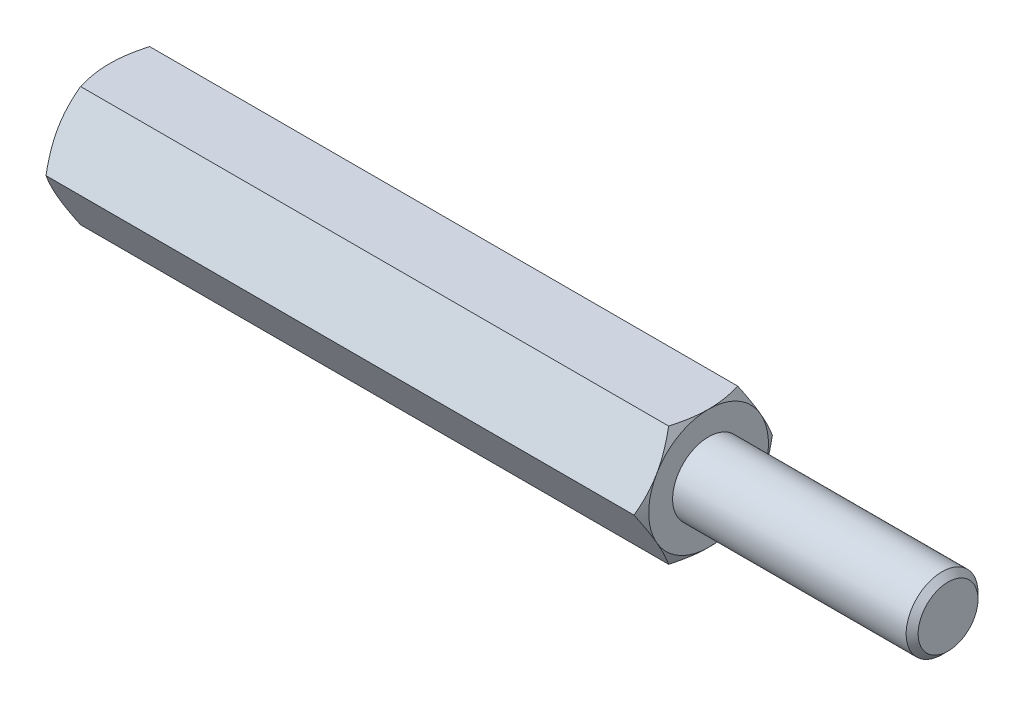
ISO-10303-21;
HEADER;
FILE_DESCRIPTION(('STEP AP214'),'2;1');
FILE_NAME('part.step','',(''),(''),'','','');
FILE_SCHEMA(('AUTOMOTIVE_DESIGN { 1 0 10303 214 1 1 1 1 }'));
ENDSEC;
DATA;
#1=APPLICATION_CONTEXT('core data for automotive mechanical design processes');
#2=APPLICATION_PROTOCOL_DEFINITION('international standard','automotive_design',2000,#1);
#3=PRODUCT_CONTEXT('',#1,'mechanical');
#4=PRODUCT('Part','Part','',(#3));
#5=PRODUCT_RELATED_PRODUCT_CATEGORY('part','',(#4));
#6=PRODUCT_DEFINITION_FORMATION('','',#4);
#7=PRODUCT_DEFINITION_CONTEXT('part definition',#1,'design');
#8=PRODUCT_DEFINITION('design','',#6,#7);
#9=PRODUCT_DEFINITION_SHAPE('','',#8);
#10=(LENGTH_UNIT() NAMED_UNIT(*) SI_UNIT(.MILLI.,.METRE.));
#11=(NAMED_UNIT(*) PLANE_ANGLE_UNIT() SI_UNIT($,.RADIAN.));
#12=(NAMED_UNIT(*) SI_UNIT($,.STERADIAN.) SOLID_ANGLE_UNIT());
#13=UNCERTAINTY_MEASURE_WITH_UNIT(LENGTH_MEASURE(1.E-05),#10,'distance_accuracy_value','');
#14=(GEOMETRIC_REPRESENTATION_CONTEXT(3) GLOBAL_UNCERTAINTY_ASSIGNED_CONTEXT((#13)) GLOBAL_UNIT_ASSIGNED_CONTEXT((#10,
#11,#12)) REPRESENTATION_CONTEXT('',''));
#15=CARTESIAN_POINT('',(0.,0.,0.));
#16=DIRECTION('',(0.,0.,1.));
#17=DIRECTION('',(1.,0.,0.));
#18=AXIS2_PLACEMENT_3D('',#15,#16,#17);
#19=CARTESIAN_POINT('',(12.5,2.5,-1.44337567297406));
#20=DIRECTION('',(1.,0.,0.));
#21=DIRECTION('',(0.,0.,-1.));
#22=AXIS2_PLACEMENT_3D('',#19,#20,#21);
#23=PLANE('',#22);
#24=CARTESIAN_POINT('',(12.5,0.,0.));
#25=DIRECTION('',(1.,0.,0.));
#26=DIRECTION('',(0.,0.,-1.));
#27=AXIS2_PLACEMENT_3D('',#24,#25,#26);
#28=CIRCLE('',#27,2.5);
#29=CARTESIAN_POINT('',(12.5,-1.25,-2.1650635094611));
#30=VERTEX_POINT('',#29);
#31=CARTESIAN_POINT('',(12.5,1.25,-2.1650635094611));
#32=VERTEX_POINT('',#31);
#33=EDGE_CURVE('E288',#30,#32,#28,.T.);
#34=ORIENTED_EDGE('',*,*,#33,.T.);
#35=CARTESIAN_POINT('',(12.5,2.5,0.));
#36=VERTEX_POINT('',#35);
#37=EDGE_CURVE('E53',#32,#36,#28,.T.);
#38=ORIENTED_EDGE('',*,*,#37,.T.);
#39=CARTESIAN_POINT('',(12.5,1.25,2.1650635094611));
#40=VERTEX_POINT('',#39);
#41=EDGE_CURVE('E297',#36,#40,#28,.T.);
#42=ORIENTED_EDGE('',*,*,#41,.T.);
#43=CARTESIAN_POINT('',(12.5,-1.25,2.1650635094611));
#44=VERTEX_POINT('',#43);
#45=EDGE_CURVE('E303',#40,#44,#28,.T.);
#46=ORIENTED_EDGE('',*,*,#45,.T.);
#47=CARTESIAN_POINT('',(12.5,0.,0.));
#48=DIRECTION('',(-1.,0.,0.));
#49=DIRECTION('',(0.,-1.,0.));
#50=AXIS2_PLACEMENT_3D('',#47,#48,#49);
#51=CIRCLE('',#50,2.5);
#52=CARTESIAN_POINT('',(12.5,-2.50000000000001,0.));
#53=VERTEX_POINT('',#52);
#54=EDGE_CURVE('E193',#53,#44,#51,.T.);
#55=ORIENTED_EDGE('',*,*,#54,.F.);
#56=EDGE_CURVE('E61',#53,#30,#28,.T.);
#57=ORIENTED_EDGE('',*,*,#56,.T.);
#58=EDGE_LOOP('',(#34,#38,#42,#46,#55,#57));
#59=FACE_BOUND('',#58,.T.);
#60=CARTESIAN_POINT('',(12.5,0.,0.));
#61=DIRECTION('',(1.,0.,0.));
#62=DIRECTION('',(0.,0.,-1.));
#63=AXIS2_PLACEMENT_3D('',#60,#61,#62);
#64=CIRCLE('',#63,1.5);
#65=CARTESIAN_POINT('',(12.5,0.,-1.5));
#66=VERTEX_POINT('',#65);
#67=EDGE_CURVE('E468',#66,#66,#64,.T.);
#68=ORIENTED_EDGE('',*,*,#67,.F.);
#69=EDGE_LOOP('',(#68));
#70=FACE_BOUND('',#69,.T.);
#71=ADVANCED_FACE('F37',(#59,#70),#23,.T.);
#72=CARTESIAN_POINT('',(12.5,0.,-2.88675134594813));
#73=DIRECTION('',(0.,-0.5,0.866025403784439));
#74=DIRECTION('',(0.,-0.866025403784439,-0.5));
#75=AXIS2_PLACEMENT_3D('',#72,#73,#74);
#76=PLANE('',#75);
#77=CARTESIAN_POINT('',(12.2766423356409,-0.000199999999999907,-2.88686681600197));
#78=CARTESIAN_POINT('',(12.3132783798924,0.109663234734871,-2.82343724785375));
#79=CARTESIAN_POINT('',(12.3465977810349,0.220474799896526,-2.75946016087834));
#80=CARTESIAN_POINT('',(12.4047577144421,0.444016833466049,-2.63039810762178));
#81=CARTESIAN_POINT('',(12.4295776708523,0.556751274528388,-2.5653108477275));
#82=CARTESIAN_POINT('',(12.468214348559,0.780822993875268,-2.43594298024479));
#83=CARTESIAN_POINT('',(12.4822882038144,0.892125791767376,-2.37168227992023));
#84=CARTESIAN_POINT('',(12.4990908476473,1.11525522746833,-2.24285844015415));
#85=CARTESIAN_POINT('',(12.5018335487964,1.22708105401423,-2.17829576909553));
#86=CARTESIAN_POINT('',(12.4961342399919,1.43604197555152,-2.05765212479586));
#87=CARTESIAN_POINT('',(12.4890916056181,1.53320831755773,-2.0015531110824));
#88=CARTESIAN_POINT('',(12.4667685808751,1.726907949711,-1.88972057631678));
#89=CARTESIAN_POINT('',(12.4514805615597,1.82344056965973,-1.8339874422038));
#90=CARTESIAN_POINT('',(12.4132609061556,2.01753972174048,-1.7219242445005));
#91=CARTESIAN_POINT('',(12.3901672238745,2.11508168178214,-1.66560836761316));
#92=CARTESIAN_POINT('',(12.3377533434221,2.30871060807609,-1.55381665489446));
#93=CARTESIAN_POINT('',(12.3084454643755,2.40480005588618,-1.49833938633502));
#94=CARTESIAN_POINT('',(12.2766423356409,2.5002,-1.44326020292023));
#95=B_SPLINE_CURVE_WITH_KNOTS('',3,(#77,#78,#79,#80,#81,#82,#83,#84,#85,#86,#87,#88,#89,#90,#91,
#92,#93,#94),.UNSPECIFIED.,.F.,.F.,(4,2,2,2,2,2,2,2,4),(0.,0.396285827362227,0.79352433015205,
1.18093086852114,1.56786160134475,1.90479741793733,2.24204551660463,2.58677531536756,
2.93082800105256),.UNSPECIFIED.);
#96=CARTESIAN_POINT('',(12.2767090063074,0.,-2.88675134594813));
#97=VERTEX_POINT('',#96);
#98=EDGE_CURVE('E343',#97,#32,#95,.T.);
#99=ORIENTED_EDGE('',*,*,#98,.F.);
#100=DIRECTION('',(-1.,0.,0.));
#101=VECTOR('',#100,1.);
#102=CARTESIAN_POINT('',(12.5,0.,-2.88675134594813));
#103=LINE('',#102,#101);
#104=CARTESIAN_POINT('',(-12.2767090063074,0.,-2.88675134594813));
#105=VERTEX_POINT('',#104);
#106=EDGE_CURVE('E264',#97,#105,#103,.T.);
#107=ORIENTED_EDGE('',*,*,#106,.T.);
#108=CARTESIAN_POINT('',(-12.2766423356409,2.5002,-1.44326020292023));
#109=CARTESIAN_POINT('',(-12.3132783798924,2.39033676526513,-1.50668977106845));
#110=CARTESIAN_POINT('',(-12.3465977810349,2.27952520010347,-1.57066685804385));
#111=CARTESIAN_POINT('',(-12.4047577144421,2.05598316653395,-1.69972891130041));
#112=CARTESIAN_POINT('',(-12.4295776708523,1.94324872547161,-1.7648161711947));
#113=CARTESIAN_POINT('',(-12.468214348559,1.71917700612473,-1.8941840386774));
#114=CARTESIAN_POINT('',(-12.4822882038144,1.60787420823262,-1.95844473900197));
#115=CARTESIAN_POINT('',(-12.4990908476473,1.38474477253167,-2.08726857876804));
#116=CARTESIAN_POINT('',(-12.5018335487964,1.27291894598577,-2.15183124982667));
#117=CARTESIAN_POINT('',(-12.4961342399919,1.06395802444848,-2.27247489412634));
#118=CARTESIAN_POINT('',(-12.4890916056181,0.96679168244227,-2.32857390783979));
#119=CARTESIAN_POINT('',(-12.4667685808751,0.773092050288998,-2.44040644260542));
#120=CARTESIAN_POINT('',(-12.4514805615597,0.676559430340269,-2.49613957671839));
#121=CARTESIAN_POINT('',(-12.4132609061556,0.482460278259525,-2.60820277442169));
#122=CARTESIAN_POINT('',(-12.3901672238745,0.38491831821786,-2.66451865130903));
#123=CARTESIAN_POINT('',(-12.3377533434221,0.191289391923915,-2.77631036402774));
#124=CARTESIAN_POINT('',(-12.3084454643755,0.0951999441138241,-2.83178763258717));
#125=CARTESIAN_POINT('',(-12.2766423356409,-0.000199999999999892,-2.88686681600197));
#126=B_SPLINE_CURVE_WITH_KNOTS('',3,(#108,#109,#110,#111,#112,#113,#114,#115,#116,#117,#118,
#119,#120,#121,#122,#123,#124,#125),.UNSPECIFIED.,.F.,.F.,(4,2,2,2,2,2,2,2,4),(0.,
0.396285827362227,0.79352433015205,1.18093086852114,1.56786160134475,1.90479741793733,
2.24204551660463,2.58677531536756,2.93082800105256),.UNSPECIFIED.);
#127=CARTESIAN_POINT('',(-12.5,1.25,-2.1650635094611));
#128=VERTEX_POINT('',#127);
#129=EDGE_CURVE('E313',#128,#105,#126,.T.);
#130=ORIENTED_EDGE('',*,*,#129,.F.);
#131=CARTESIAN_POINT('',(-12.2767090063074,2.5,-1.44337567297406));
#132=VERTEX_POINT('',#131);
#133=EDGE_CURVE('E392',#132,#128,#126,.T.);
#134=ORIENTED_EDGE('',*,*,#133,.F.);
#135=DIRECTION('',(-1.,0.,0.));
#136=VECTOR('',#135,1.);
#137=CARTESIAN_POINT('',(12.5,2.5,-1.44337567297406));
#138=LINE('',#137,#136);
#139=CARTESIAN_POINT('',(12.2767090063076,2.5,-1.44337567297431));
#140=VERTEX_POINT('',#139);
#141=EDGE_CURVE('E279',#140,#132,#138,.T.);
#142=ORIENTED_EDGE('',*,*,#141,.F.);
#143=EDGE_CURVE('E229',#32,#140,#95,.T.);
#144=ORIENTED_EDGE('',*,*,#143,.F.);
#145=EDGE_LOOP('',(#99,#107,#130,#134,#142,#144));
#146=FACE_BOUND('',#145,.T.);
#147=ADVANCED_FACE('F148',(#146),#76,.F.);
#148=CARTESIAN_POINT('',(12.5,2.5,-1.44337567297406));
#149=DIRECTION('',(0.,-1.,0.));
#150=DIRECTION('',(0.,0.,-1.));
#151=AXIS2_PLACEMENT_3D('',#148,#149,#150);
#152=PLANE('',#151);
#153=CARTESIAN_POINT('',(11.2680338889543,2.5,-3.90158441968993));
#154=CARTESIAN_POINT('',(11.3212077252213,2.5,-3.79217004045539));
#155=CARTESIAN_POINT('',(11.3738786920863,2.5,-3.68250707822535));
#156=CARTESIAN_POINT('',(11.4779324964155,2.5,-3.46255185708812));
#157=CARTESIAN_POINT('',(11.5293151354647,2.5,-3.35225950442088));
#158=CARTESIAN_POINT('',(11.6307630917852,2.5,-3.13035696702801));
#159=CARTESIAN_POINT('',(11.6808199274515,2.5,-3.0187428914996));
#160=CARTESIAN_POINT('',(11.7789171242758,2.5,-2.79463535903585));
#161=CARTESIAN_POINT('',(11.8269575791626,2.5,-2.68214194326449));
#162=CARTESIAN_POINT('',(11.9220184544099,2.5,-2.45240385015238));
#163=CARTESIAN_POINT('',(11.9689543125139,2.5,-2.33512399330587));
#164=CARTESIAN_POINT('',(12.0593326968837,2.5,-2.09920133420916));
#165=CARTESIAN_POINT('',(12.1027748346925,2.5,-1.98055838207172));
#166=CARTESIAN_POINT('',(12.1850435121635,2.5,-1.74193489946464));
#167=CARTESIAN_POINT('',(12.2238791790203,2.5,-1.6219575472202));
#168=CARTESIAN_POINT('',(12.2957050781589,2.5,-1.38028205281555));
#169=CARTESIAN_POINT('',(12.3286971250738,2.5,-1.25858445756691));
#170=CARTESIAN_POINT('',(12.3870959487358,2.5,-1.01406369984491));
#171=CARTESIAN_POINT('',(12.4125437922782,2.5,-0.89125052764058));
#172=CARTESIAN_POINT('',(12.4544275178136,2.5,-0.64407172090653));
#173=CARTESIAN_POINT('',(12.4708643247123,2.5,-0.519706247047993));
#174=CARTESIAN_POINT('',(12.4932006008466,2.5,-0.271679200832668));
#175=CARTESIAN_POINT('',(12.4992375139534,2.5,-0.148030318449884));
#176=CARTESIAN_POINT('',(12.5006256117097,2.5,0.0993395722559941));
#177=CARTESIAN_POINT('',(12.4959765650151,2.5,0.223060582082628));
#178=CARTESIAN_POINT('',(12.4794044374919,2.5,0.432351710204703));
#179=CARTESIAN_POINT('',(12.4701066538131,2.5,0.518143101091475));
#180=CARTESIAN_POINT('',(12.4469384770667,2.5,0.689112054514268));
#181=CARTESIAN_POINT('',(12.4330674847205,2.5,0.774289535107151));
#182=CARTESIAN_POINT('',(12.3853202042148,2.5,1.02876599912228));
#183=CARTESIAN_POINT('',(12.3453176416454,2.5,1.19691958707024));
#184=CARTESIAN_POINT('',(12.2522656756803,2.5,1.53362893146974));
#185=CARTESIAN_POINT('',(12.1989362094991,2.5,1.70210423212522));
#186=CARTESIAN_POINT('',(12.1123716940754,2.5,1.95247339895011));
#187=CARTESIAN_POINT('',(12.0824247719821,2.5,2.03553184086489));
#188=CARTESIAN_POINT('',(12.0206840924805,2.5,2.20095860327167));
#189=CARTESIAN_POINT('',(11.9888903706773,2.5,2.2833269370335));
#190=CARTESIAN_POINT('',(11.904014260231,2.5,2.49723312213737));
#191=CARTESIAN_POINT('',(11.8497173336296,2.5,2.6282879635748));
#192=CARTESIAN_POINT('',(11.7381273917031,2.5,2.88912034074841));
#193=CARTESIAN_POINT('',(11.6808341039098,2.5,3.01889775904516));
#194=CARTESIAN_POINT('',(11.5639348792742,2.5,3.27745045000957));
#195=CARTESIAN_POINT('',(11.504328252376,2.5,3.40622540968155));
#196=CARTESIAN_POINT('',(11.3833234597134,2.5,3.66293235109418));
#197=CARTESIAN_POINT('',(11.321925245,2.5,3.79086430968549));
#198=CARTESIAN_POINT('',(11.1354580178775,2.5,4.17399495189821));
#199=CARTESIAN_POINT('',(11.0082824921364,2.5,4.42816724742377));
#200=CARTESIAN_POINT('',(10.7503455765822,2.5,4.93461464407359));
#201=CARTESIAN_POINT('',(10.6195848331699,2.5,5.18689007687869));
#202=CARTESIAN_POINT('',(10.3687100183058,2.5,5.66512451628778));
#203=CARTESIAN_POINT('',(10.2488298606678,2.5,5.89120644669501));
#204=CARTESIAN_POINT('',(10.0075902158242,2.5,6.34259369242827));
#205=CARTESIAN_POINT('',(9.88623065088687,2.5,6.56789896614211));
#206=CARTESIAN_POINT('',(9.64278038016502,2.5,7.01722044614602));
#207=CARTESIAN_POINT('',(9.52069305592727,2.5,7.24123848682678));
#208=CARTESIAN_POINT('',(9.27566624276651,2.5,7.68878772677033));
#209=CARTESIAN_POINT('',(9.15272681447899,2.5,7.9123189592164));
#210=CARTESIAN_POINT('',(9.02947566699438,2.5,8.13567697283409));
#211=B_SPLINE_CURVE_WITH_KNOTS('',3,(#153,#154,#155,#156,#157,#158,#159,#160,#161,#162,#163,
#164,#165,#166,#167,#168,#169,#170,#171,#172,#173,#174,#175,#176,#177,#178,#179,#180,#181,#182,
#183,#184,#185,#186,#187,#188,#189,#190,#191,#192,#193,#194,#195,#196,#197,#198,#199,#200,#201,
#202,#203,#204,#205,#206,#207,#208,#209,#210),.UNSPECIFIED.,.F.,.F.,(4,2,2,2,2,2,2,2,2,2,2,2,2,
2,2,2,2,2,2,2,2,2,2,2,2,2,2,2,4),(0.,0.364957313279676,0.729970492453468,1.09692930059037,
1.46387103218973,1.84279746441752,2.22176597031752,2.59997058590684,2.97805755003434,
3.35404692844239,3.72999770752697,4.10094071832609,4.47189175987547,4.73064905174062,
4.98944026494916,5.5072907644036,6.03710483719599,6.30196454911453,6.56681915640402,
6.99233818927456,7.41789598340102,7.84358170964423,8.26927907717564,9.12186602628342,
9.9743002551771,10.7419897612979,11.5097197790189,12.2750964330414,13.0404191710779),.UNSPECIFIED.);
#212=EDGE_CURVE('E227',#140,#36,#211,.T.);
#213=ORIENTED_EDGE('',*,*,#212,.F.);
#214=ORIENTED_EDGE('',*,*,#141,.T.);
#215=CARTESIAN_POINT('',(-11.2680338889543,2.5,-3.90158441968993));
#216=CARTESIAN_POINT('',(-11.3212077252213,2.5,-3.79217004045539));
#217=CARTESIAN_POINT('',(-11.3738786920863,2.5,-3.68250707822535));
#218=CARTESIAN_POINT('',(-11.4779324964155,2.5,-3.46255185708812));
#219=CARTESIAN_POINT('',(-11.5293151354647,2.5,-3.35225950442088));
#220=CARTESIAN_POINT('',(-11.6307630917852,2.5,-3.13035696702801));
#221=CARTESIAN_POINT('',(-11.6808199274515,2.5,-3.0187428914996));
#222=CARTESIAN_POINT('',(-11.7789171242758,2.5,-2.79463535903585));
#223=CARTESIAN_POINT('',(-11.8269575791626,2.5,-2.68214194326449));
#224=CARTESIAN_POINT('',(-11.9220184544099,2.5,-2.45240385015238));
#225=CARTESIAN_POINT('',(-11.9689543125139,2.5,-2.33512399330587));
#226=CARTESIAN_POINT('',(-12.0593326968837,2.5,-2.09920133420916));
#227=CARTESIAN_POINT('',(-12.1027748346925,2.5,-1.98055838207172));
#228=CARTESIAN_POINT('',(-12.1850435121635,2.5,-1.74193489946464));
#229=CARTESIAN_POINT('',(-12.2238791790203,2.5,-1.6219575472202));
#230=CARTESIAN_POINT('',(-12.2957050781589,2.5,-1.38028205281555));
#231=CARTESIAN_POINT('',(-12.3286971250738,2.5,-1.25858445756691));
#232=CARTESIAN_POINT('',(-12.3870959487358,2.5,-1.01406369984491));
#233=CARTESIAN_POINT('',(-12.4125437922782,2.5,-0.89125052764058));
#234=CARTESIAN_POINT('',(-12.4544275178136,2.5,-0.64407172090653));
#235=CARTESIAN_POINT('',(-12.4708643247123,2.5,-0.519706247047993));
#236=CARTESIAN_POINT('',(-12.4932006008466,2.5,-0.271679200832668));
#237=CARTESIAN_POINT('',(-12.4992375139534,2.5,-0.148030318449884));
#238=CARTESIAN_POINT('',(-12.5006256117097,2.5,0.0993395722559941));
#239=CARTESIAN_POINT('',(-12.4959765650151,2.5,0.223060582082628));
#240=CARTESIAN_POINT('',(-12.4794044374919,2.5,0.432351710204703));
#241=CARTESIAN_POINT('',(-12.4701066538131,2.5,0.518143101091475));
#242=CARTESIAN_POINT('',(-12.4469384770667,2.5,0.689112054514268));
#243=CARTESIAN_POINT('',(-12.4330674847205,2.5,0.774289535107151));
#244=CARTESIAN_POINT('',(-12.3853202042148,2.5,1.02876599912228));
#245=CARTESIAN_POINT('',(-12.3453176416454,2.5,1.19691958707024));
#246=CARTESIAN_POINT('',(-12.2522656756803,2.5,1.53362893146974));
#247=CARTESIAN_POINT('',(-12.1989362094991,2.5,1.70210423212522));
#248=CARTESIAN_POINT('',(-12.1123716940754,2.5,1.95247339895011));
#249=CARTESIAN_POINT('',(-12.0824247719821,2.5,2.03553184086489));
#250=CARTESIAN_POINT('',(-12.0206840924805,2.5,2.20095860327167));
#251=CARTESIAN_POINT('',(-11.9888903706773,2.5,2.2833269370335));
#252=CARTESIAN_POINT('',(-11.904014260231,2.5,2.49723312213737));
#253=CARTESIAN_POINT('',(-11.8497173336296,2.5,2.6282879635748));
#254=CARTESIAN_POINT('',(-11.7381273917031,2.5,2.88912034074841));
#255=CARTESIAN_POINT('',(-11.6808341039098,2.5,3.01889775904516));
#256=CARTESIAN_POINT('',(-11.5639348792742,2.5,3.27745045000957));
#257=CARTESIAN_POINT('',(-11.504328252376,2.5,3.40622540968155));
#258=CARTESIAN_POINT('',(-11.3833234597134,2.5,3.66293235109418));
#259=CARTESIAN_POINT('',(-11.321925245,2.5,3.79086430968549));
#260=CARTESIAN_POINT('',(-11.1354580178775,2.5,4.17399495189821));
#261=CARTESIAN_POINT('',(-11.0082824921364,2.5,4.42816724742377));
#262=CARTESIAN_POINT('',(-10.7503455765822,2.5,4.93461464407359));
#263=CARTESIAN_POINT('',(-10.6195848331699,2.5,5.18689007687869));
#264=CARTESIAN_POINT('',(-10.3687100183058,2.5,5.66512451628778));
#265=CARTESIAN_POINT('',(-10.2488298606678,2.5,5.89120644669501));
#266=CARTESIAN_POINT('',(-10.0075902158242,2.5,6.34259369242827));
#267=CARTESIAN_POINT('',(-9.88623065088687,2.5,6.56789896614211));
#268=CARTESIAN_POINT('',(-9.64278038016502,2.5,7.01722044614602));
#269=CARTESIAN_POINT('',(-9.52069305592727,2.5,7.24123848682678));
#270=CARTESIAN_POINT('',(-9.27566624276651,2.5,7.68878772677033));
#271=CARTESIAN_POINT('',(-9.15272681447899,2.5,7.9123189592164));
#272=CARTESIAN_POINT('',(-9.02947566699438,2.5,8.13567697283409));
#273=B_SPLINE_CURVE_WITH_KNOTS('',3,(#215,#216,#217,#218,#219,#220,#221,#222,#223,#224,#225,
#226,#227,#228,#229,#230,#231,#232,#233,#234,#235,#236,#237,#238,#239,#240,#241,#242,#243,#244,
#245,#246,#247,#248,#249,#250,#251,#252,#253,#254,#255,#256,#257,#258,#259,#260,#261,#262,#263,
#264,#265,#266,#267,#268,#269,#270,#271,#272),.UNSPECIFIED.,.F.,.F.,(4,2,2,2,2,2,2,2,2,2,2,2,2,
2,2,2,2,2,2,2,2,2,2,2,2,2,2,2,4),(0.,0.364957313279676,0.729970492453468,1.09692930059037,
1.46387103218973,1.84279746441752,2.22176597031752,2.59997058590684,2.97805755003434,
3.35404692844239,3.72999770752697,4.10094071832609,4.47189175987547,4.73064905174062,
4.98944026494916,5.5072907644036,6.03710483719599,6.30196454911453,6.56681915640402,
6.99233818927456,7.41789598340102,7.84358170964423,8.26927907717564,9.12186602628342,
9.9743002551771,10.7419897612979,11.5097197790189,12.2750964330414,13.0404191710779),.UNSPECIFIED.);
#274=CARTESIAN_POINT('',(-12.5,2.5,0.));
#275=VERTEX_POINT('',#274);
#276=EDGE_CURVE('E241',#275,#132,#273,.F.);
#277=ORIENTED_EDGE('',*,*,#276,.F.);
#278=CARTESIAN_POINT('',(-12.2767090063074,2.5,1.44337567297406));
#279=VERTEX_POINT('',#278);
#280=EDGE_CURVE('E249',#279,#275,#273,.F.);
#281=ORIENTED_EDGE('',*,*,#280,.F.);
#282=DIRECTION('',(-1.,0.,0.));
#283=VECTOR('',#282,1.);
#284=CARTESIAN_POINT('',(12.5,2.5,1.44337567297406));
#285=LINE('',#284,#283);
#286=CARTESIAN_POINT('',(12.2767090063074,2.5,1.44337567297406));
#287=VERTEX_POINT('',#286);
#288=EDGE_CURVE('E276',#287,#279,#285,.T.);
#289=ORIENTED_EDGE('',*,*,#288,.F.);
#290=EDGE_CURVE('E221',#36,#287,#211,.T.);
#291=ORIENTED_EDGE('',*,*,#290,.F.);
#292=EDGE_LOOP('',(#213,#214,#277,#281,#289,#291));
#293=FACE_BOUND('',#292,.T.);
#294=ADVANCED_FACE('F153',(#293),#152,.F.);
#295=CARTESIAN_POINT('',(12.5,2.5,1.44337567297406));
#296=DIRECTION('',(0.,-0.5,-0.866025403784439));
#297=DIRECTION('',(0.,0.866025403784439,-0.5));
#298=AXIS2_PLACEMENT_3D('',#295,#296,#297);
#299=PLANE('',#298);
#300=CARTESIAN_POINT('',(12.2766423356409,2.5002,1.44326020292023));
#301=CARTESIAN_POINT('',(12.3132783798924,2.39033676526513,1.50668977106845));
#302=CARTESIAN_POINT('',(12.3465977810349,2.27952520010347,1.57066685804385));
#303=CARTESIAN_POINT('',(12.4047577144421,2.05598316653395,1.69972891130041));
#304=CARTESIAN_POINT('',(12.4295776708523,1.94324872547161,1.7648161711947));
#305=CARTESIAN_POINT('',(12.468214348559,1.71917700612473,1.8941840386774));
#306=CARTESIAN_POINT('',(12.4822882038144,1.60787420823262,1.95844473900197));
#307=CARTESIAN_POINT('',(12.4990908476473,1.38474477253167,2.08726857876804));
#308=CARTESIAN_POINT('',(12.5018335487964,1.27291894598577,2.15183124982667));
#309=CARTESIAN_POINT('',(12.4961342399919,1.06395802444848,2.27247489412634));
#310=CARTESIAN_POINT('',(12.4890916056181,0.96679168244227,2.32857390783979));
#311=CARTESIAN_POINT('',(12.4667685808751,0.773092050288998,2.44040644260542));
#312=CARTESIAN_POINT('',(12.4514805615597,0.676559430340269,2.49613957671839));
#313=CARTESIAN_POINT('',(12.4132609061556,0.482460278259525,2.60820277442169));
#314=CARTESIAN_POINT('',(12.3901672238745,0.38491831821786,2.66451865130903));
#315=CARTESIAN_POINT('',(12.3377533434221,0.191289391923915,2.77631036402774));
#316=CARTESIAN_POINT('',(12.3084454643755,0.0951999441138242,2.83178763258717));
#317=CARTESIAN_POINT('',(12.2766423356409,-0.000199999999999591,2.88686681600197));
#318=B_SPLINE_CURVE_WITH_KNOTS('',3,(#300,#301,#302,#303,#304,#305,#306,#307,#308,#309,#310,
#311,#312,#313,#314,#315,#316,#317),.UNSPECIFIED.,.F.,.F.,(4,2,2,2,2,2,2,2,4),(0.,
0.396285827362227,0.79352433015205,1.18093086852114,1.56786160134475,1.90479741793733,
2.24204551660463,2.58677531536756,2.93082800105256),.UNSPECIFIED.);
#319=EDGE_CURVE('E228',#287,#40,#318,.T.);
#320=ORIENTED_EDGE('',*,*,#319,.F.);
#321=ORIENTED_EDGE('',*,*,#288,.T.);
#322=CARTESIAN_POINT('',(-12.2766423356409,-0.000199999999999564,2.88686681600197));
#323=CARTESIAN_POINT('',(-12.3132783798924,0.109663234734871,2.82343724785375));
#324=CARTESIAN_POINT('',(-12.3465977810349,0.220474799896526,2.75946016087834));
#325=CARTESIAN_POINT('',(-12.4047577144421,0.44401683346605,2.63039810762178));
#326=CARTESIAN_POINT('',(-12.4295776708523,0.556751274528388,2.5653108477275));
#327=CARTESIAN_POINT('',(-12.468214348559,0.780822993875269,2.43594298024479));
#328=CARTESIAN_POINT('',(-12.4822882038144,0.892125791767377,2.37168227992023));
#329=CARTESIAN_POINT('',(-12.4990908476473,1.11525522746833,2.24285844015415));
#330=CARTESIAN_POINT('',(-12.5018335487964,1.22708105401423,2.17829576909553));
#331=CARTESIAN_POINT('',(-12.4961342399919,1.43604197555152,2.05765212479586));
#332=CARTESIAN_POINT('',(-12.4890916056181,1.53320831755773,2.0015531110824));
#333=CARTESIAN_POINT('',(-12.4667685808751,1.726907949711,1.88972057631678));
#334=CARTESIAN_POINT('',(-12.4514805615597,1.82344056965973,1.8339874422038));
#335=CARTESIAN_POINT('',(-12.4132609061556,2.01753972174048,1.7219242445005));
#336=CARTESIAN_POINT('',(-12.3901672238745,2.11508168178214,1.66560836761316));
#337=CARTESIAN_POINT('',(-12.3377533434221,2.30871060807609,1.55381665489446));
#338=CARTESIAN_POINT('',(-12.3084454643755,2.40480005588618,1.49833938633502));
#339=CARTESIAN_POINT('',(-12.2766423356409,2.5002,1.44326020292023));
#340=B_SPLINE_CURVE_WITH_KNOTS('',3,(#322,#323,#324,#325,#326,#327,#328,#329,#330,#331,#332,
#333,#334,#335,#336,#337,#338,#339),.UNSPECIFIED.,.F.,.F.,(4,2,2,2,2,2,2,2,4),(0.,
0.396285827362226,0.79352433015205,1.18093086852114,1.56786160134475,1.90479741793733,
2.24204551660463,2.58677531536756,2.93082800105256),.UNSPECIFIED.);
#341=CARTESIAN_POINT('',(-12.5,1.25,2.1650635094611));
#342=VERTEX_POINT('',#341);
#343=EDGE_CURVE('E255',#342,#279,#340,.T.);
#344=ORIENTED_EDGE('',*,*,#343,.F.);
#345=CARTESIAN_POINT('',(-12.2767090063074,0.,2.88675134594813));
#346=VERTEX_POINT('',#345);
#347=EDGE_CURVE('E262',#346,#342,#340,.T.);
#348=ORIENTED_EDGE('',*,*,#347,.F.);
#349=DIRECTION('',(-1.,0.,0.));
#350=VECTOR('',#349,1.);
#351=CARTESIAN_POINT('',(12.5,0.,2.88675134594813));
#352=LINE('',#351,#350);
#353=CARTESIAN_POINT('',(12.2767090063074,0.,2.88675134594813));
#354=VERTEX_POINT('',#353);
#355=EDGE_CURVE('E273',#354,#346,#352,.T.);
#356=ORIENTED_EDGE('',*,*,#355,.F.);
#357=EDGE_CURVE('E215',#40,#354,#318,.T.);
#358=ORIENTED_EDGE('',*,*,#357,.F.);
#359=EDGE_LOOP('',(#320,#321,#344,#348,#356,#358));
#360=FACE_BOUND('',#359,.T.);
#361=ADVANCED_FACE('F235',(#360),#299,.F.);
#362=CARTESIAN_POINT('',(12.5,0.,2.88675134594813));
#363=DIRECTION('',(0.,0.5,-0.866025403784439));
#364=DIRECTION('',(0.,0.866025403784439,0.5));
#365=AXIS2_PLACEMENT_3D('',#362,#363,#364);
#366=PLANE('',#365);
#367=CARTESIAN_POINT('',(12.2766423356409,0.000200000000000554,2.88686681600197));
#368=CARTESIAN_POINT('',(12.3132783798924,-0.10966323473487,2.82343724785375));
#369=CARTESIAN_POINT('',(12.3465977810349,-0.220474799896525,2.75946016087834));
#370=CARTESIAN_POINT('',(12.4047577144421,-0.444016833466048,2.63039810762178));
#371=CARTESIAN_POINT('',(12.4295776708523,-0.556751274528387,2.5653108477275));
#372=CARTESIAN_POINT('',(12.468214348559,-0.780822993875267,2.43594298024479));
#373=CARTESIAN_POINT('',(12.4822882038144,-0.892125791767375,2.37168227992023));
#374=CARTESIAN_POINT('',(12.4990908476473,-1.11525522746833,2.24285844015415));
#375=CARTESIAN_POINT('',(12.5018335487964,-1.22708105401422,2.17829576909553));
#376=CARTESIAN_POINT('',(12.496134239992,-1.43604197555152,2.05765212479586));
#377=CARTESIAN_POINT('',(12.4890916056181,-1.53320831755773,2.0015531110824));
#378=CARTESIAN_POINT('',(12.4667685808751,-1.726907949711,1.88972057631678));
#379=CARTESIAN_POINT('',(12.4514805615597,-1.82344056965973,1.8339874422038));
#380=CARTESIAN_POINT('',(12.4132609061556,-2.01753972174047,1.7219242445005));
#381=CARTESIAN_POINT('',(12.3901672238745,-2.11508168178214,1.66560836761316));
#382=CARTESIAN_POINT('',(12.3377533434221,-2.30871060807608,1.55381665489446));
#383=CARTESIAN_POINT('',(12.3084454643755,-2.40480005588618,1.49833938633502));
#384=CARTESIAN_POINT('',(12.2766423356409,-2.5002,1.44326020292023));
#385=B_SPLINE_CURVE_WITH_KNOTS('',3,(#367,#368,#369,#370,#371,#372,#373,#374,#375,#376,#377,
#378,#379,#380,#381,#382,#383,#384),.UNSPECIFIED.,.F.,.F.,(4,2,2,2,2,2,2,2,4),(0.,
0.396285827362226,0.793524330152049,1.18093086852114,1.56786160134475,1.90479741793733,
2.24204551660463,2.58677531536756,2.93082800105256),.UNSPECIFIED.);
#386=EDGE_CURVE('E319',#354,#44,#385,.T.);
#387=ORIENTED_EDGE('',*,*,#386,.F.);
#388=ORIENTED_EDGE('',*,*,#355,.T.);
#389=CARTESIAN_POINT('',(-12.2766423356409,-2.5002,1.44326020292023));
#390=CARTESIAN_POINT('',(-12.3132783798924,-2.39033676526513,1.50668977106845));
#391=CARTESIAN_POINT('',(-12.3465977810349,-2.27952520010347,1.57066685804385));
#392=CARTESIAN_POINT('',(-12.4047577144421,-2.05598316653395,1.69972891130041));
#393=CARTESIAN_POINT('',(-12.4295776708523,-1.94324872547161,1.7648161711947));
#394=CARTESIAN_POINT('',(-12.468214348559,-1.71917700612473,1.8941840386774));
#395=CARTESIAN_POINT('',(-12.4822882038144,-1.60787420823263,1.95844473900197));
#396=CARTESIAN_POINT('',(-12.4990908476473,-1.38474477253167,2.08726857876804));
#397=CARTESIAN_POINT('',(-12.5018335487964,-1.27291894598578,2.15183124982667));
#398=CARTESIAN_POINT('',(-12.496134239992,-1.06395802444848,2.27247489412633));
#399=CARTESIAN_POINT('',(-12.4890916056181,-0.966791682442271,2.32857390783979));
#400=CARTESIAN_POINT('',(-12.4667685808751,-0.773092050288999,2.44040644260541));
#401=CARTESIAN_POINT('',(-12.4514805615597,-0.676559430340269,2.49613957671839));
#402=CARTESIAN_POINT('',(-12.4132609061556,-0.482460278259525,2.60820277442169));
#403=CARTESIAN_POINT('',(-12.3901672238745,-0.38491831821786,2.66451865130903));
#404=CARTESIAN_POINT('',(-12.3377533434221,-0.191289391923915,2.77631036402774));
#405=CARTESIAN_POINT('',(-12.3084454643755,-0.0951999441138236,2.83178763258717));
#406=CARTESIAN_POINT('',(-12.2766423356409,0.000200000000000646,2.88686681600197));
#407=B_SPLINE_CURVE_WITH_KNOTS('',3,(#389,#390,#391,#392,#393,#394,#395,#396,#397,#398,#399,
#400,#401,#402,#403,#404,#405,#406),.UNSPECIFIED.,.F.,.F.,(4,2,2,2,2,2,2,2,4),(0.,
0.396285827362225,0.793524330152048,1.18093086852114,1.56786160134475,1.90479741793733,
2.24204551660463,2.58677531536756,2.93082800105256),.UNSPECIFIED.);
#408=CARTESIAN_POINT('',(-12.5,-1.25,2.1650635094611));
#409=VERTEX_POINT('',#408);
#410=EDGE_CURVE('E263',#409,#346,#407,.T.);
#411=ORIENTED_EDGE('',*,*,#410,.F.);
#412=CARTESIAN_POINT('',(-12.2767090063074,-2.5,1.44337567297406));
#413=VERTEX_POINT('',#412);
#414=EDGE_CURVE('E250',#413,#409,#407,.T.);
#415=ORIENTED_EDGE('',*,*,#414,.F.);
#416=DIRECTION('',(-1.,0.,0.));
#417=VECTOR('',#416,1.);
#418=CARTESIAN_POINT('',(12.5,-2.5,1.44337567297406));
#419=LINE('',#418,#417);
#420=CARTESIAN_POINT('',(12.2767090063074,-2.5,1.44337567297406));
#421=VERTEX_POINT('',#420);
#422=EDGE_CURVE('E270',#421,#413,#419,.T.);
#423=ORIENTED_EDGE('',*,*,#422,.F.);
#424=EDGE_CURVE('E210',#44,#421,#385,.T.);
#425=ORIENTED_EDGE('',*,*,#424,.F.);
#426=EDGE_LOOP('',(#387,#388,#411,#415,#423,#425));
#427=FACE_BOUND('',#426,.T.);
#428=ADVANCED_FACE('F361',(#427),#366,.F.);
#429=CARTESIAN_POINT('',(12.5,-2.5,1.44337567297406));
#430=DIRECTION('',(0.,1.,0.));
#431=DIRECTION('',(0.,0.,1.));
#432=AXIS2_PLACEMENT_3D('',#429,#430,#431);
#433=PLANE('',#432);
#434=CARTESIAN_POINT('',(11.2680338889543,-2.5,-3.90158441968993));
#435=CARTESIAN_POINT('',(11.3212077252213,-2.5,-3.79217004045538));
#436=CARTESIAN_POINT('',(11.3738786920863,-2.5,-3.68250707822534));
#437=CARTESIAN_POINT('',(11.4779324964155,-2.5,-3.46255185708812));
#438=CARTESIAN_POINT('',(11.5293151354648,-2.5,-3.35225950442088));
#439=CARTESIAN_POINT('',(11.6307630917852,-2.5,-3.130356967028));
#440=CARTESIAN_POINT('',(11.6808199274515,-2.5,-3.01874289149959));
#441=CARTESIAN_POINT('',(11.7789171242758,-2.5,-2.79463535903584));
#442=CARTESIAN_POINT('',(11.8269575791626,-2.5,-2.68214194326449));
#443=CARTESIAN_POINT('',(11.9220184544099,-2.5,-2.45240385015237));
#444=CARTESIAN_POINT('',(11.9689543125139,-2.5,-2.33512399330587));
#445=CARTESIAN_POINT('',(12.0593326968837,-2.5,-2.09920133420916));
#446=CARTESIAN_POINT('',(12.1027748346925,-2.5,-1.98055838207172));
#447=CARTESIAN_POINT('',(12.1850435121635,-2.5,-1.74193489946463));
#448=CARTESIAN_POINT('',(12.2238791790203,-2.5,-1.6219575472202));
#449=CARTESIAN_POINT('',(12.2957050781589,-2.5,-1.38028205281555));
#450=CARTESIAN_POINT('',(12.3286971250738,-2.5,-1.25858445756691));
#451=CARTESIAN_POINT('',(12.3870959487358,-2.5,-1.01406369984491));
#452=CARTESIAN_POINT('',(12.4125437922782,-2.5,-0.891250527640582));
#453=CARTESIAN_POINT('',(12.4544275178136,-2.5,-0.644071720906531));
#454=CARTESIAN_POINT('',(12.4708643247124,-2.5,-0.519706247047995));
#455=CARTESIAN_POINT('',(12.4932006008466,-2.5,-0.271679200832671));
#456=CARTESIAN_POINT('',(12.4992375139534,-2.5,-0.148030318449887));
#457=CARTESIAN_POINT('',(12.5006256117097,-2.5,0.0993395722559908));
#458=CARTESIAN_POINT('',(12.4959765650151,-2.5,0.223060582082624));
#459=CARTESIAN_POINT('',(12.4794044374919,-2.5,0.432351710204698));
#460=CARTESIAN_POINT('',(12.4701066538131,-2.5,0.51814310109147));
#461=CARTESIAN_POINT('',(12.4469384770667,-2.5,0.689112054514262));
#462=CARTESIAN_POINT('',(12.4330674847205,-2.5,0.774289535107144));
#463=CARTESIAN_POINT('',(12.3853202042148,-2.5,1.02876599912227));
#464=CARTESIAN_POINT('',(12.3453176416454,-2.5,1.19691958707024));
#465=CARTESIAN_POINT('',(12.2522656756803,-2.5,1.53362893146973));
#466=CARTESIAN_POINT('',(12.1989362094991,-2.5,1.70210423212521));
#467=CARTESIAN_POINT('',(12.1123716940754,-2.5,1.9524733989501));
#468=CARTESIAN_POINT('',(12.0824247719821,-2.5,2.03553184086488));
#469=CARTESIAN_POINT('',(12.0206840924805,-2.5,2.20095860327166));
#470=CARTESIAN_POINT('',(11.9888903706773,-2.5,2.28332693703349));
#471=CARTESIAN_POINT('',(11.904014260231,-2.5,2.49723312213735));
#472=CARTESIAN_POINT('',(11.8497173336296,-2.5,2.62828796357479));
#473=CARTESIAN_POINT('',(11.7381273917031,-2.5,2.8891203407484));
#474=CARTESIAN_POINT('',(11.6808341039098,-2.5,3.01889775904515));
#475=CARTESIAN_POINT('',(11.5639348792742,-2.5,3.27745045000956));
#476=CARTESIAN_POINT('',(11.504328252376,-2.5,3.40622540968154));
#477=CARTESIAN_POINT('',(11.3833234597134,-2.5,3.66293235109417));
#478=CARTESIAN_POINT('',(11.321925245,-2.5,3.79086430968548));
#479=CARTESIAN_POINT('',(11.1354580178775,-2.5,4.1739949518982));
#480=CARTESIAN_POINT('',(11.0082824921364,-2.5,4.42816724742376));
#481=CARTESIAN_POINT('',(10.7503455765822,-2.5,4.93461464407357));
#482=CARTESIAN_POINT('',(10.6195848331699,-2.5,5.18689007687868));
#483=CARTESIAN_POINT('',(10.3687100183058,-2.5,5.66512451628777));
#484=CARTESIAN_POINT('',(10.2488298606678,-2.5,5.891206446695));
#485=CARTESIAN_POINT('',(10.0075902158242,-2.5,6.34259369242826));
#486=CARTESIAN_POINT('',(9.88623065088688,-2.5,6.5678989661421));
#487=CARTESIAN_POINT('',(9.64278038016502,-2.5,7.01722044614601));
#488=CARTESIAN_POINT('',(9.52069305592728,-2.5,7.24123848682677));
#489=CARTESIAN_POINT('',(9.27566624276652,-2.5,7.68878772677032));
#490=CARTESIAN_POINT('',(9.15272681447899,-2.5,7.91231895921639));
#491=CARTESIAN_POINT('',(9.02947566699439,-2.5,8.13567697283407));
#492=B_SPLINE_CURVE_WITH_KNOTS('',3,(#434,#435,#436,#437,#438,#439,#440,#441,#442,#443,#444,
#445,#446,#447,#448,#449,#450,#451,#452,#453,#454,#455,#456,#457,#458,#459,#460,#461,#462,#463,
#464,#465,#466,#467,#468,#469,#470,#471,#472,#473,#474,#475,#476,#477,#478,#479,#480,#481,#482,
#483,#484,#485,#486,#487,#488,#489,#490,#491),.UNSPECIFIED.,.F.,.F.,(4,2,2,2,2,2,2,2,2,2,2,2,2,
2,2,2,2,2,2,2,2,2,2,2,2,2,2,2,4),(0.,0.364957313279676,0.729970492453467,1.09692930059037,
1.46387103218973,1.84279746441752,2.22176597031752,2.59997058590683,2.97805755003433,
3.35404692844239,3.72999770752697,4.10094071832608,4.47189175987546,4.73064905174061,
4.98944026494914,5.50729076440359,6.03710483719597,6.3019645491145,6.566819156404,
6.99233818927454,7.417895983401,7.84358170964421,8.26927907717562,9.1218660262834,
9.97430025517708,10.7419897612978,11.5097197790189,12.2750964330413,13.0404191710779),.UNSPECIFIED.);
#493=EDGE_CURVE('E325',#421,#53,#492,.F.);
#494=ORIENTED_EDGE('',*,*,#493,.F.);
#495=ORIENTED_EDGE('',*,*,#422,.T.);
#496=CARTESIAN_POINT('',(-11.2680338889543,-2.5,-3.90158441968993));
#497=CARTESIAN_POINT('',(-11.3212077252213,-2.5,-3.79217004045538));
#498=CARTESIAN_POINT('',(-11.3738786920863,-2.5,-3.68250707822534));
#499=CARTESIAN_POINT('',(-11.4779324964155,-2.5,-3.46255185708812));
#500=CARTESIAN_POINT('',(-11.5293151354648,-2.5,-3.35225950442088));
#501=CARTESIAN_POINT('',(-11.6307630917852,-2.5,-3.130356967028));
#502=CARTESIAN_POINT('',(-11.6808199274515,-2.5,-3.01874289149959));
#503=CARTESIAN_POINT('',(-11.7789171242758,-2.5,-2.79463535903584));
#504=CARTESIAN_POINT('',(-11.8269575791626,-2.5,-2.68214194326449));
#505=CARTESIAN_POINT('',(-11.9220184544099,-2.5,-2.45240385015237));
#506=CARTESIAN_POINT('',(-11.9689543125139,-2.5,-2.33512399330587));
#507=CARTESIAN_POINT('',(-12.0593326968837,-2.5,-2.09920133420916));
#508=CARTESIAN_POINT('',(-12.1027748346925,-2.5,-1.98055838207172));
#509=CARTESIAN_POINT('',(-12.1850435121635,-2.5,-1.74193489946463));
#510=CARTESIAN_POINT('',(-12.2238791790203,-2.5,-1.6219575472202));
#511=CARTESIAN_POINT('',(-12.2957050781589,-2.5,-1.38028205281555));
#512=CARTESIAN_POINT('',(-12.3286971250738,-2.5,-1.25858445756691));
#513=CARTESIAN_POINT('',(-12.3870959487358,-2.5,-1.01406369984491));
#514=CARTESIAN_POINT('',(-12.4125437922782,-2.5,-0.891250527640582));
#515=CARTESIAN_POINT('',(-12.4544275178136,-2.5,-0.644071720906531));
#516=CARTESIAN_POINT('',(-12.4708643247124,-2.5,-0.519706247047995));
#517=CARTESIAN_POINT('',(-12.4932006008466,-2.5,-0.271679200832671));
#518=CARTESIAN_POINT('',(-12.4992375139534,-2.5,-0.148030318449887));
#519=CARTESIAN_POINT('',(-12.5006256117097,-2.5,0.0993395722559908));
#520=CARTESIAN_POINT('',(-12.4959765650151,-2.5,0.223060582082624));
#521=CARTESIAN_POINT('',(-12.4794044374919,-2.5,0.432351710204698));
#522=CARTESIAN_POINT('',(-12.4701066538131,-2.5,0.51814310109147));
#523=CARTESIAN_POINT('',(-12.4469384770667,-2.5,0.689112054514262));
#524=CARTESIAN_POINT('',(-12.4330674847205,-2.5,0.774289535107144));
#525=CARTESIAN_POINT('',(-12.3853202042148,-2.5,1.02876599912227));
#526=CARTESIAN_POINT('',(-12.3453176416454,-2.5,1.19691958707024));
#527=CARTESIAN_POINT('',(-12.2522656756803,-2.5,1.53362893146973));
#528=CARTESIAN_POINT('',(-12.1989362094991,-2.5,1.70210423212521));
#529=CARTESIAN_POINT('',(-12.1123716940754,-2.5,1.9524733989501));
#530=CARTESIAN_POINT('',(-12.0824247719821,-2.5,2.03553184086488));
#531=CARTESIAN_POINT('',(-12.0206840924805,-2.5,2.20095860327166));
#532=CARTESIAN_POINT('',(-11.9888903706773,-2.5,2.28332693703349));
#533=CARTESIAN_POINT('',(-11.904014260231,-2.5,2.49723312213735));
#534=CARTESIAN_POINT('',(-11.8497173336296,-2.5,2.62828796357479));
#535=CARTESIAN_POINT('',(-11.7381273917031,-2.5,2.8891203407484));
#536=CARTESIAN_POINT('',(-11.6808341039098,-2.5,3.01889775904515));
#537=CARTESIAN_POINT('',(-11.5639348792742,-2.5,3.27745045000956));
#538=CARTESIAN_POINT('',(-11.504328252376,-2.5,3.40622540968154));
#539=CARTESIAN_POINT('',(-11.3833234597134,-2.5,3.66293235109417));
#540=CARTESIAN_POINT('',(-11.321925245,-2.5,3.79086430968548));
#541=CARTESIAN_POINT('',(-11.1354580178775,-2.5,4.1739949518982));
#542=CARTESIAN_POINT('',(-11.0082824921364,-2.5,4.42816724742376));
#543=CARTESIAN_POINT('',(-10.7503455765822,-2.5,4.93461464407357));
#544=CARTESIAN_POINT('',(-10.6195848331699,-2.5,5.18689007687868));
#545=CARTESIAN_POINT('',(-10.3687100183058,-2.5,5.66512451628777));
#546=CARTESIAN_POINT('',(-10.2488298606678,-2.5,5.891206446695));
#547=CARTESIAN_POINT('',(-10.0075902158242,-2.5,6.34259369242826));
#548=CARTESIAN_POINT('',(-9.88623065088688,-2.5,6.5678989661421));
#549=CARTESIAN_POINT('',(-9.64278038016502,-2.5,7.01722044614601));
#550=CARTESIAN_POINT('',(-9.52069305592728,-2.5,7.24123848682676));
#551=CARTESIAN_POINT('',(-9.27566624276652,-2.5,7.68878772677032));
#552=CARTESIAN_POINT('',(-9.15272681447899,-2.5,7.91231895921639));
#553=CARTESIAN_POINT('',(-9.02947566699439,-2.5,8.13567697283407));
#554=B_SPLINE_CURVE_WITH_KNOTS('',3,(#496,#497,#498,#499,#500,#501,#502,#503,#504,#505,#506,
#507,#508,#509,#510,#511,#512,#513,#514,#515,#516,#517,#518,#519,#520,#521,#522,#523,#524,#525,
#526,#527,#528,#529,#530,#531,#532,#533,#534,#535,#536,#537,#538,#539,#540,#541,#542,#543,#544,
#545,#546,#547,#548,#549,#550,#551,#552,#553),.UNSPECIFIED.,.F.,.F.,(4,2,2,2,2,2,2,2,2,2,2,2,2,
2,2,2,2,2,2,2,2,2,2,2,2,2,2,2,4),(0.,0.364957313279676,0.729970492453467,1.09692930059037,
1.46387103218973,1.84279746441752,2.22176597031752,2.59997058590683,2.97805755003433,
3.35404692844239,3.72999770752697,4.10094071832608,4.47189175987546,4.73064905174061,
4.98944026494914,5.50729076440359,6.03710483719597,6.30196454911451,6.566819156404,
6.99233818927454,7.417895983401,7.84358170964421,8.26927907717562,9.1218660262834,
9.97430025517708,10.7419897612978,11.5097197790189,12.2750964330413,13.0404191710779),.UNSPECIFIED.);
#555=CARTESIAN_POINT('',(-12.5,-2.50000000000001,0.));
#556=VERTEX_POINT('',#555);
#557=EDGE_CURVE('E390',#556,#413,#554,.T.);
#558=ORIENTED_EDGE('',*,*,#557,.F.);
#559=CARTESIAN_POINT('',(-12.2767090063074,-2.5,-1.44337567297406));
#560=VERTEX_POINT('',#559);
#561=EDGE_CURVE('E393',#560,#556,#554,.T.);
#562=ORIENTED_EDGE('',*,*,#561,.F.);
#563=DIRECTION('',(-1.,0.,0.));
#564=VECTOR('',#563,1.);
#565=CARTESIAN_POINT('',(12.5,-2.5,-1.44337567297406));
#566=LINE('',#565,#564);
#567=CARTESIAN_POINT('',(12.2767090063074,-2.5,-1.44337567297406));
#568=VERTEX_POINT('',#567);
#569=EDGE_CURVE('E267',#568,#560,#566,.T.);
#570=ORIENTED_EDGE('',*,*,#569,.F.);
#571=EDGE_CURVE('E195',#53,#568,#492,.F.);
#572=ORIENTED_EDGE('',*,*,#571,.F.);
#573=EDGE_LOOP('',(#494,#495,#558,#562,#570,#572));
#574=FACE_BOUND('',#573,.T.);
#575=ADVANCED_FACE('F172',(#574),#433,.F.);
#576=CARTESIAN_POINT('',(12.5,-2.5,-1.44337567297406));
#577=DIRECTION('',(0.,0.5,0.866025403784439));
#578=DIRECTION('',(0.,-0.866025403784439,0.5));
#579=AXIS2_PLACEMENT_3D('',#576,#577,#578);
#580=PLANE('',#579);
#581=CARTESIAN_POINT('',(12.2766423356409,-2.5002,-1.44326020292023));
#582=CARTESIAN_POINT('',(12.3132783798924,-2.39033676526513,-1.50668977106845));
#583=CARTESIAN_POINT('',(12.3465977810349,-2.27952520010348,-1.57066685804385));
#584=CARTESIAN_POINT('',(12.4047577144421,-2.05598316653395,-1.69972891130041));
#585=CARTESIAN_POINT('',(12.4295776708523,-1.94324872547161,-1.7648161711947));
#586=CARTESIAN_POINT('',(12.468214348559,-1.71917700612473,-1.8941840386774));
#587=CARTESIAN_POINT('',(12.4822882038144,-1.60787420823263,-1.95844473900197));
#588=CARTESIAN_POINT('',(12.4990908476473,-1.38474477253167,-2.08726857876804));
#589=CARTESIAN_POINT('',(12.5018335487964,-1.27291894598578,-2.15183124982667));
#590=CARTESIAN_POINT('',(12.496134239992,-1.06395802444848,-2.27247489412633));
#591=CARTESIAN_POINT('',(12.4890916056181,-0.966791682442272,-2.32857390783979));
#592=CARTESIAN_POINT('',(12.4667685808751,-0.773092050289,-2.44040644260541));
#593=CARTESIAN_POINT('',(12.4514805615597,-0.67655943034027,-2.49613957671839));
#594=CARTESIAN_POINT('',(12.4132609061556,-0.482460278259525,-2.60820277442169));
#595=CARTESIAN_POINT('',(12.3901672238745,-0.384918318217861,-2.66451865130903));
#596=CARTESIAN_POINT('',(12.3377533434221,-0.191289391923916,-2.77631036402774));
#597=CARTESIAN_POINT('',(12.3084454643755,-0.0951999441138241,-2.83178763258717));
#598=CARTESIAN_POINT('',(12.2766423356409,0.000200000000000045,-2.88686681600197));
#599=B_SPLINE_CURVE_WITH_KNOTS('',3,(#581,#582,#583,#584,#585,#586,#587,#588,#589,#590,#591,
#592,#593,#594,#595,#596,#597,#598),.UNSPECIFIED.,.F.,.F.,(4,2,2,2,2,2,2,2,4),(0.,
0.396285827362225,0.793524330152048,1.18093086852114,1.56786160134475,1.90479741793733,
2.24204551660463,2.58677531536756,2.93082800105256),.UNSPECIFIED.);
#600=EDGE_CURVE('E192',#568,#30,#599,.T.);
#601=ORIENTED_EDGE('',*,*,#600,.F.);
#602=ORIENTED_EDGE('',*,*,#569,.T.);
#603=CARTESIAN_POINT('',(-12.2766423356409,0.000200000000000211,-2.88686681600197));
#604=CARTESIAN_POINT('',(-12.3132783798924,-0.109663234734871,-2.82343724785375));
#605=CARTESIAN_POINT('',(-12.3465977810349,-0.220474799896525,-2.75946016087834));
#606=CARTESIAN_POINT('',(-12.4047577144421,-0.444016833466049,-2.63039810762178));
#607=CARTESIAN_POINT('',(-12.4295776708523,-0.556751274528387,-2.5653108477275));
#608=CARTESIAN_POINT('',(-12.468214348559,-0.780822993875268,-2.43594298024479));
#609=CARTESIAN_POINT('',(-12.4822882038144,-0.892125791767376,-2.37168227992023));
#610=CARTESIAN_POINT('',(-12.4990908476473,-1.11525522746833,-2.24285844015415));
#611=CARTESIAN_POINT('',(-12.5018335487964,-1.22708105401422,-2.17829576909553));
#612=CARTESIAN_POINT('',(-12.496134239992,-1.43604197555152,-2.05765212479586));
#613=CARTESIAN_POINT('',(-12.4890916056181,-1.53320831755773,-2.0015531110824));
#614=CARTESIAN_POINT('',(-12.4667685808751,-1.726907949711,-1.88972057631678));
#615=CARTESIAN_POINT('',(-12.4514805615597,-1.82344056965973,-1.8339874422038));
#616=CARTESIAN_POINT('',(-12.4132609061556,-2.01753972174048,-1.7219242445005));
#617=CARTESIAN_POINT('',(-12.3901672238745,-2.11508168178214,-1.66560836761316));
#618=CARTESIAN_POINT('',(-12.3377533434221,-2.30871060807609,-1.55381665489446));
#619=CARTESIAN_POINT('',(-12.3084454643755,-2.40480005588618,-1.49833938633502));
#620=CARTESIAN_POINT('',(-12.2766423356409,-2.5002,-1.44326020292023));
#621=B_SPLINE_CURVE_WITH_KNOTS('',3,(#603,#604,#605,#606,#607,#608,#609,#610,#611,#612,#613,
#614,#615,#616,#617,#618,#619,#620),.UNSPECIFIED.,.F.,.F.,(4,2,2,2,2,2,2,2,4),(0.,
0.396285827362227,0.79352433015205,1.18093086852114,1.56786160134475,1.90479741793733,
2.24204551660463,2.58677531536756,2.93082800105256),.UNSPECIFIED.);
#622=CARTESIAN_POINT('',(-12.5,-1.25,-2.1650635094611));
#623=VERTEX_POINT('',#622);
#624=EDGE_CURVE('E178',#623,#560,#621,.T.);
#625=ORIENTED_EDGE('',*,*,#624,.F.);
#626=EDGE_CURVE('E399',#105,#623,#621,.T.);
#627=ORIENTED_EDGE('',*,*,#626,.F.);
#628=ORIENTED_EDGE('',*,*,#106,.F.);
#629=EDGE_CURVE('E185',#30,#97,#599,.T.);
#630=ORIENTED_EDGE('',*,*,#629,.F.);
#631=EDGE_LOOP('',(#601,#602,#625,#627,#628,#630));
#632=FACE_BOUND('',#631,.T.);
#633=ADVANCED_FACE('F167',(#632),#580,.F.);
#634=CARTESIAN_POINT('',(-12.5,0.,0.));
#635=DIRECTION('',(1.,0.,0.));
#636=DIRECTION('',(0.,1.,0.));
#637=AXIS2_PLACEMENT_3D('',#634,#635,#636);
#638=CONICAL_SURFACE('',#637,2.5,1.0471975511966);
#639=ORIENTED_EDGE('',*,*,#129,.T.);
#640=ORIENTED_EDGE('',*,*,#626,.T.);
#641=CARTESIAN_POINT('',(-12.5,0.,0.));
#642=DIRECTION('',(1.,0.,0.));
#643=DIRECTION('',(0.,0.,-1.));
#644=AXIS2_PLACEMENT_3D('',#641,#642,#643);
#645=CIRCLE('',#644,2.5);
#646=EDGE_CURVE('E282',#623,#128,#645,.T.);
#647=ORIENTED_EDGE('',*,*,#646,.T.);
#648=EDGE_LOOP('',(#639,#640,#647));
#649=FACE_BOUND('',#648,.T.);
#650=ADVANCED_FACE('F171',(#649),#638,.T.);
#651=ORIENTED_EDGE('',*,*,#561,.T.);
#652=EDGE_CURVE('E286',#556,#623,#645,.T.);
#653=ORIENTED_EDGE('',*,*,#652,.T.);
#654=ORIENTED_EDGE('',*,*,#624,.T.);
#655=EDGE_LOOP('',(#651,#653,#654));
#656=FACE_BOUND('',#655,.T.);
#657=ADVANCED_FACE('F406',(#656),#638,.T.);
#658=ORIENTED_EDGE('',*,*,#414,.T.);
#659=CARTESIAN_POINT('',(-12.5,0.,0.));
#660=DIRECTION('',(-1.,0.,0.));
#661=DIRECTION('',(0.,-1.,0.));
#662=AXIS2_PLACEMENT_3D('',#659,#660,#661);
#663=CIRCLE('',#662,2.5);
#664=EDGE_CURVE('E348',#556,#409,#663,.T.);
#665=ORIENTED_EDGE('',*,*,#664,.F.);
#666=ORIENTED_EDGE('',*,*,#557,.T.);
#667=EDGE_LOOP('',(#658,#665,#666));
#668=FACE_BOUND('',#667,.T.);
#669=ADVANCED_FACE('F499',(#668),#638,.T.);
#670=ORIENTED_EDGE('',*,*,#347,.T.);
#671=EDGE_CURVE('E315',#342,#409,#645,.T.);
#672=ORIENTED_EDGE('',*,*,#671,.T.);
#673=ORIENTED_EDGE('',*,*,#410,.T.);
#674=EDGE_LOOP('',(#670,#672,#673));
#675=FACE_BOUND('',#674,.T.);
#676=ADVANCED_FACE('F158',(#675),#638,.T.);
#677=ORIENTED_EDGE('',*,*,#343,.T.);
#678=ORIENTED_EDGE('',*,*,#280,.T.);
#679=EDGE_CURVE('E318',#275,#342,#645,.T.);
#680=ORIENTED_EDGE('',*,*,#679,.T.);
#681=EDGE_LOOP('',(#677,#678,#680));
#682=FACE_BOUND('',#681,.T.);
#683=ADVANCED_FACE('F373',(#682),#638,.T.);
#684=ORIENTED_EDGE('',*,*,#276,.T.);
#685=ORIENTED_EDGE('',*,*,#133,.T.);
#686=EDGE_CURVE('E287',#128,#275,#645,.T.);
#687=ORIENTED_EDGE('',*,*,#686,.T.);
#688=EDGE_LOOP('',(#684,#685,#687));
#689=FACE_BOUND('',#688,.T.);
#690=ADVANCED_FACE('F165',(#689),#638,.T.);
#691=CARTESIAN_POINT('',(-12.5,2.5,-1.44337567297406));
#692=DIRECTION('',(1.,0.,0.));
#693=DIRECTION('',(0.,0.,-1.));
#694=AXIS2_PLACEMENT_3D('',#691,#692,#693);
#695=PLANE('',#694);
#696=CARTESIAN_POINT('',(-12.5,0.,0.));
#697=DIRECTION('',(-1.,0.,0.));
#698=DIRECTION('',(0.,0.,1.));
#699=AXIS2_PLACEMENT_3D('',#696,#697,#698);
#700=CIRCLE('',#699,1.25);
#701=CARTESIAN_POINT('',(-12.5,0.,1.25));
#702=VERTEX_POINT('',#701);
#703=EDGE_CURVE('E474',#702,#702,#700,.T.);
#704=ORIENTED_EDGE('',*,*,#703,.F.);
#705=EDGE_LOOP('',(#704));
#706=FACE_BOUND('',#705,.T.);
#707=ORIENTED_EDGE('',*,*,#686,.F.);
#708=ORIENTED_EDGE('',*,*,#646,.F.);
#709=ORIENTED_EDGE('',*,*,#652,.F.);
#710=ORIENTED_EDGE('',*,*,#664,.T.);
#711=ORIENTED_EDGE('',*,*,#671,.F.);
#712=ORIENTED_EDGE('',*,*,#679,.F.);
#713=EDGE_LOOP('',(#707,#708,#709,#710,#711,#712));
#714=FACE_BOUND('',#713,.T.);
#715=ADVANCED_FACE('F161',(#706,#714),#695,.F.);
#716=CARTESIAN_POINT('',(12.5,0.,0.));
#717=DIRECTION('',(-1.,0.,0.));
#718=DIRECTION('',(0.,1.,0.));
#719=AXIS2_PLACEMENT_3D('',#716,#717,#718);
#720=CONICAL_SURFACE('',#719,2.5,1.0471975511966);
#721=ORIENTED_EDGE('',*,*,#98,.T.);
#722=ORIENTED_EDGE('',*,*,#33,.F.);
#723=ORIENTED_EDGE('',*,*,#629,.T.);
#724=EDGE_LOOP('',(#721,#722,#723));
#725=FACE_BOUND('',#724,.T.);
#726=ADVANCED_FACE('F164',(#725),#720,.T.);
#727=ORIENTED_EDGE('',*,*,#571,.T.);
#728=ORIENTED_EDGE('',*,*,#600,.T.);
#729=ORIENTED_EDGE('',*,*,#56,.F.);
#730=EDGE_LOOP('',(#727,#728,#729));
#731=FACE_BOUND('',#730,.T.);
#732=ADVANCED_FACE('F202',(#731),#720,.T.);
#733=ORIENTED_EDGE('',*,*,#424,.T.);
#734=ORIENTED_EDGE('',*,*,#493,.T.);
#735=ORIENTED_EDGE('',*,*,#54,.T.);
#736=EDGE_LOOP('',(#733,#734,#735));
#737=FACE_BOUND('',#736,.T.);
#738=ADVANCED_FACE('F479',(#737),#720,.T.);
#739=ORIENTED_EDGE('',*,*,#357,.T.);
#740=ORIENTED_EDGE('',*,*,#386,.T.);
#741=ORIENTED_EDGE('',*,*,#45,.F.);
#742=EDGE_LOOP('',(#739,#740,#741));
#743=FACE_BOUND('',#742,.T.);
#744=ADVANCED_FACE('F358',(#743),#720,.T.);
#745=ORIENTED_EDGE('',*,*,#290,.T.);
#746=ORIENTED_EDGE('',*,*,#319,.T.);
#747=ORIENTED_EDGE('',*,*,#41,.F.);
#748=EDGE_LOOP('',(#745,#746,#747));
#749=FACE_BOUND('',#748,.T.);
#750=ADVANCED_FACE('F353',(#749),#720,.T.);
#751=ORIENTED_EDGE('',*,*,#143,.T.);
#752=ORIENTED_EDGE('',*,*,#212,.T.);
#753=ORIENTED_EDGE('',*,*,#37,.F.);
#754=EDGE_LOOP('',(#751,#752,#753));
#755=FACE_BOUND('',#754,.T.);
#756=ADVANCED_FACE('F143',(#755),#720,.T.);
#757=CARTESIAN_POINT('',(-2.5,0.,0.));
#758=DIRECTION('',(-1.,0.,0.));
#759=DIRECTION('',(0.,0.,1.));
#760=AXIS2_PLACEMENT_3D('',#757,#758,#759);
#761=CYLINDRICAL_SURFACE('',#760,1.25);
#762=CARTESIAN_POINT('',(-2.5,0.,0.));
#763=DIRECTION('',(1.,0.,0.));
#764=DIRECTION('',(0.,0.,-1.));
#765=AXIS2_PLACEMENT_3D('',#762,#763,#764);
#766=CIRCLE('',#765,1.25);
#767=CARTESIAN_POINT('',(-2.5,0.,-1.25));
#768=VERTEX_POINT('',#767);
#769=EDGE_CURVE('E470',#768,#768,#766,.T.);
#770=ORIENTED_EDGE('',*,*,#769,.T.);
#771=EDGE_LOOP('',(#770));
#772=FACE_BOUND('',#771,.T.);
#773=ORIENTED_EDGE('',*,*,#703,.T.);
#774=EDGE_LOOP('',(#773));
#775=FACE_BOUND('',#774,.T.);
#776=ADVANCED_FACE('F133',(#772,#775),#761,.F.);
#777=CARTESIAN_POINT('',(-1.77831216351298,0.,0.));
#778=DIRECTION('',(-1.,0.,0.));
#779=DIRECTION('',(0.,0.,1.));
#780=AXIS2_PLACEMENT_3D('',#777,#778,#779);
#781=CONICAL_SURFACE('',#780,0.,1.0471975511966);
#782=ORIENTED_EDGE('',*,*,#769,.F.);
#783=EDGE_LOOP('',(#782));
#784=FACE_BOUND('',#783,.T.);
#785=CARTESIAN_POINT('',(-1.77831216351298,0.,0.));
#786=VERTEX_POINT('',#785);
#787=VERTEX_LOOP('',#786);
#788=FACE_BOUND('',#787,.T.);
#789=ADVANCED_FACE('F130',(#784,#788),#781,.F.);
#790=CARTESIAN_POINT('',(22.5,0.,0.));
#791=DIRECTION('',(-1.,0.,0.));
#792=DIRECTION('',(0.,0.,1.));
#793=AXIS2_PLACEMENT_3D('',#790,#791,#792);
#794=CYLINDRICAL_SURFACE('',#793,1.5);
#795=CARTESIAN_POINT('',(22.25,0.,0.));
#796=DIRECTION('',(1.,0.,0.));
#797=DIRECTION('',(0.,0.,-1.));
#798=AXIS2_PLACEMENT_3D('',#795,#796,#797);
#799=CIRCLE('',#798,1.5);
#800=CARTESIAN_POINT('',(22.25,0.,-1.5));
#801=VERTEX_POINT('',#800);
#802=EDGE_CURVE('E11',#801,#801,#799,.F.);
#803=ORIENTED_EDGE('',*,*,#802,.T.);
#804=EDGE_LOOP('',(#803));
#805=FACE_BOUND('',#804,.T.);
#806=ORIENTED_EDGE('',*,*,#67,.T.);
#807=EDGE_LOOP('',(#806));
#808=FACE_BOUND('',#807,.T.);
#809=ADVANCED_FACE('F132',(#805,#808),#794,.T.);
#810=CARTESIAN_POINT('',(22.5,0.,0.));
#811=DIRECTION('',(1.,0.,0.));
#812=DIRECTION('',(0.,0.,-1.));
#813=AXIS2_PLACEMENT_3D('',#810,#811,#812);
#814=PLANE('',#813);
#815=CARTESIAN_POINT('',(22.5,0.,0.));
#816=DIRECTION('',(1.,0.,0.));
#817=DIRECTION('',(0.,0.,-1.));
#818=AXIS2_PLACEMENT_3D('',#815,#816,#817);
#819=CIRCLE('',#818,1.25);
#820=CARTESIAN_POINT('',(22.5,0.,-1.25));
#821=VERTEX_POINT('',#820);
#822=EDGE_CURVE('E46',#821,#821,#819,.T.);
#823=ORIENTED_EDGE('',*,*,#822,.T.);
#824=EDGE_LOOP('',(#823));
#825=FACE_BOUND('',#824,.T.);
#826=ADVANCED_FACE('F140',(#825),#814,.T.);
#827=CARTESIAN_POINT('',(22.5,0.,0.));
#828=DIRECTION('',(-1.,0.,0.));
#829=DIRECTION('',(0.,0.,1.));
#830=AXIS2_PLACEMENT_3D('',#827,#828,#829);
#831=CONICAL_SURFACE('',#830,1.25,0.785398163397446);
#832=ORIENTED_EDGE('',*,*,#802,.F.);
#833=EDGE_LOOP('',(#832));
#834=FACE_BOUND('',#833,.T.);
#835=ORIENTED_EDGE('',*,*,#822,.F.);
#836=EDGE_LOOP('',(#835));
#837=FACE_BOUND('',#836,.T.);
#838=ADVANCED_FACE('F39',(#834,#837),#831,.T.);
#839=CLOSED_SHELL('',(#71,#147,#294,#361,#428,#575,#633,#650,#657,#669,#676,#683,#690,#715,#726,
#732,#738,#744,#750,#756,#776,#789,#809,#826,#838));
#840=MANIFOLD_SOLID_BREP('B2',#839);
#841=ADVANCED_BREP_SHAPE_REPRESENTATION('',(#18,#840),#14);
#842=SHAPE_DEFINITION_REPRESENTATION(#9,#841);
ENDSEC;
END-ISO-10303-21;
